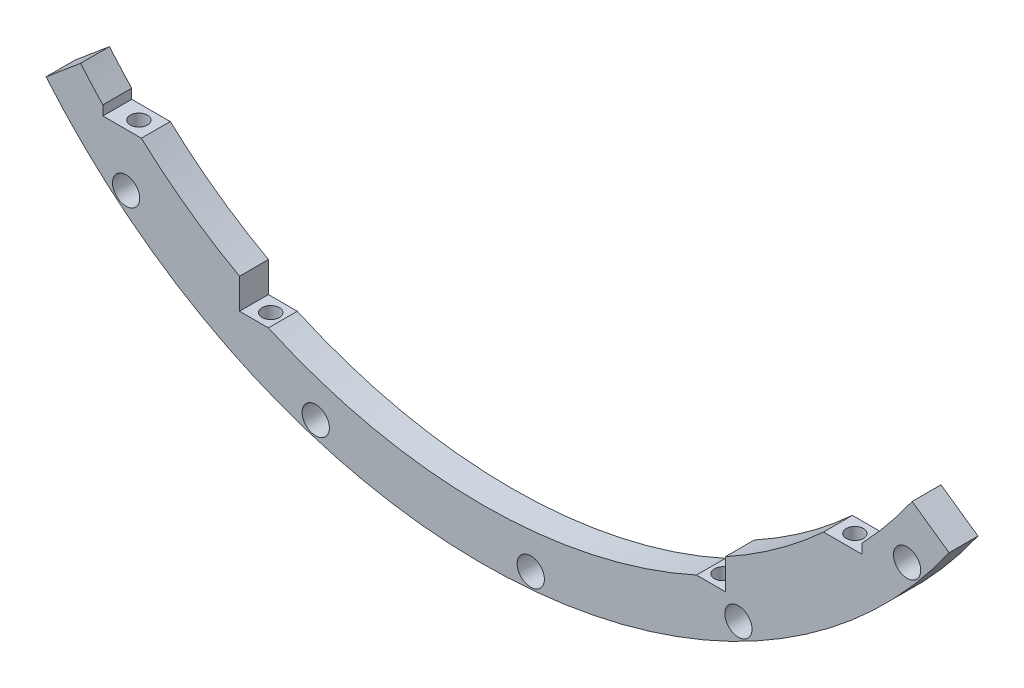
ISO-10303-21;
HEADER;
FILE_DESCRIPTION(('STEP AP214'),'2;1');
FILE_NAME('part.step','',(''),(''),'','','');
FILE_SCHEMA(('AUTOMOTIVE_DESIGN { 1 0 10303 214 1 1 1 1 }'));
ENDSEC;
DATA;
#1=APPLICATION_CONTEXT('core data for automotive mechanical design processes');
#2=APPLICATION_PROTOCOL_DEFINITION('international standard','automotive_design',2000,#1);
#3=PRODUCT_CONTEXT('',#1,'mechanical');
#4=PRODUCT('Part','Part','',(#3));
#5=PRODUCT_RELATED_PRODUCT_CATEGORY('part','',(#4));
#6=PRODUCT_DEFINITION_FORMATION('','',#4);
#7=PRODUCT_DEFINITION_CONTEXT('part definition',#1,'design');
#8=PRODUCT_DEFINITION('design','',#6,#7);
#9=PRODUCT_DEFINITION_SHAPE('','',#8);
#10=(LENGTH_UNIT() NAMED_UNIT(*) SI_UNIT(.MILLI.,.METRE.));
#11=(NAMED_UNIT(*) PLANE_ANGLE_UNIT() SI_UNIT($,.RADIAN.));
#12=(NAMED_UNIT(*) SI_UNIT($,.STERADIAN.) SOLID_ANGLE_UNIT());
#13=UNCERTAINTY_MEASURE_WITH_UNIT(LENGTH_MEASURE(1.E-05),#10,'distance_accuracy_value','');
#14=(GEOMETRIC_REPRESENTATION_CONTEXT(3) GLOBAL_UNCERTAINTY_ASSIGNED_CONTEXT((#13)) GLOBAL_UNIT_ASSIGNED_CONTEXT((#10,
#11,#12)) REPRESENTATION_CONTEXT('',''));
#15=CARTESIAN_POINT('',(0.,0.,0.));
#16=DIRECTION('',(0.,0.,1.));
#17=DIRECTION('',(1.,0.,0.));
#18=AXIS2_PLACEMENT_3D('',#15,#16,#17);
#19=CARTESIAN_POINT('',(35.306,-77.932869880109,4.7625));
#20=DIRECTION('',(0.,-1.,0.));
#21=DIRECTION('',(1.,0.,0.));
#22=AXIS2_PLACEMENT_3D('',#19,#20,#21);
#23=PLANE('',#22);
#24=DIRECTION('',(-1.,0.,0.));
#25=VECTOR('',#24,1.);
#26=CARTESIAN_POINT('',(35.306,-77.932869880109,0.));
#27=LINE('',#26,#25);
#28=CARTESIAN_POINT('',(40.0685,-77.932869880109,0.));
#29=VERTEX_POINT('',#28);
#30=CARTESIAN_POINT('',(35.306,-77.932869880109,0.));
#31=VERTEX_POINT('',#30);
#32=EDGE_CURVE('E209',#29,#31,#27,.T.);
#33=ORIENTED_EDGE('',*,*,#32,.T.);
#34=DIRECTION('',(0.,0.,-1.));
#35=VECTOR('',#34,1.);
#36=CARTESIAN_POINT('',(35.306,-77.932869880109,4.7625));
#37=LINE('',#36,#35);
#38=CARTESIAN_POINT('',(35.306,-77.932869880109,4.7625));
#39=VERTEX_POINT('',#38);
#40=EDGE_CURVE('E173',#39,#31,#37,.T.);
#41=ORIENTED_EDGE('',*,*,#40,.F.);
#42=DIRECTION('',(-1.,0.,0.));
#43=VECTOR('',#42,1.);
#44=CARTESIAN_POINT('',(35.306,-77.932869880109,4.7625));
#45=LINE('',#44,#43);
#46=CARTESIAN_POINT('',(40.0685,-77.932869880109,4.7625));
#47=VERTEX_POINT('',#46);
#48=EDGE_CURVE('E164',#47,#39,#45,.T.);
#49=ORIENTED_EDGE('',*,*,#48,.F.);
#50=DIRECTION('',(0.,0.,-1.));
#51=VECTOR('',#50,1.);
#52=CARTESIAN_POINT('',(40.0685,-77.932869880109,4.7625));
#53=LINE('',#52,#51);
#54=EDGE_CURVE('E218',#47,#29,#53,.T.);
#55=ORIENTED_EDGE('',*,*,#54,.T.);
#56=EDGE_LOOP('',(#33,#41,#49,#55));
#57=FACE_BOUND('',#56,.T.);
#58=CARTESIAN_POINT('',(37.30625,-77.9328698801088,2.38125));
#59=DIRECTION('',(0.,1.,0.));
#60=DIRECTION('',(0.,0.,1.));
#61=AXIS2_PLACEMENT_3D('',#58,#59,#60);
#62=CIRCLE('',#61,1.42239999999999);
#63=CARTESIAN_POINT('',(37.30625,-77.9328698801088,3.80364999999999));
#64=VERTEX_POINT('',#63);
#65=EDGE_CURVE('E381',#64,#64,#62,.T.);
#66=ORIENTED_EDGE('',*,*,#65,.F.);
#67=EDGE_LOOP('',(#66));
#68=FACE_BOUND('',#67,.T.);
#69=ADVANCED_FACE('F30',(#57,#68),#23,.F.);
#70=CARTESIAN_POINT('',(-40.0685,-77.932869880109,4.7625));
#71=DIRECTION('',(0.,-1.,0.));
#72=DIRECTION('',(1.,0.,0.));
#73=AXIS2_PLACEMENT_3D('',#70,#71,#72);
#74=PLANE('',#73);
#75=DIRECTION('',(-1.,0.,0.));
#76=VECTOR('',#75,1.);
#77=CARTESIAN_POINT('',(-40.0685,-77.932869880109,0.));
#78=LINE('',#77,#76);
#79=CARTESIAN_POINT('',(-35.306,-77.932869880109,0.));
#80=VERTEX_POINT('',#79);
#81=CARTESIAN_POINT('',(-40.0685,-77.932869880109,0.));
#82=VERTEX_POINT('',#81);
#83=EDGE_CURVE('E106',#80,#82,#78,.T.);
#84=ORIENTED_EDGE('',*,*,#83,.T.);
#85=DIRECTION('',(0.,0.,-1.));
#86=VECTOR('',#85,1.);
#87=CARTESIAN_POINT('',(-40.0685,-77.932869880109,4.7625));
#88=LINE('',#87,#86);
#89=CARTESIAN_POINT('',(-40.0685,-77.932869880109,4.7625));
#90=VERTEX_POINT('',#89);
#91=EDGE_CURVE('E174',#90,#82,#88,.T.);
#92=ORIENTED_EDGE('',*,*,#91,.F.);
#93=DIRECTION('',(-1.,0.,0.));
#94=VECTOR('',#93,1.);
#95=CARTESIAN_POINT('',(-40.0685,-77.932869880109,4.7625));
#96=LINE('',#95,#94);
#97=CARTESIAN_POINT('',(-35.306,-77.932869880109,4.7625));
#98=VERTEX_POINT('',#97);
#99=EDGE_CURVE('E162',#98,#90,#96,.T.);
#100=ORIENTED_EDGE('',*,*,#99,.F.);
#101=DIRECTION('',(0.,0.,-1.));
#102=VECTOR('',#101,1.);
#103=CARTESIAN_POINT('',(-35.306,-77.932869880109,4.7625));
#104=LINE('',#103,#102);
#105=EDGE_CURVE('E169',#98,#80,#104,.T.);
#106=ORIENTED_EDGE('',*,*,#105,.T.);
#107=EDGE_LOOP('',(#84,#92,#100,#106));
#108=FACE_BOUND('',#107,.T.);
#109=CARTESIAN_POINT('',(-37.30625,-77.932869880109,2.38125));
#110=DIRECTION('',(0.,1.,0.));
#111=DIRECTION('',(0.,0.,1.));
#112=AXIS2_PLACEMENT_3D('',#109,#110,#111);
#113=CIRCLE('',#112,1.42239999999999);
#114=CARTESIAN_POINT('',(-37.30625,-77.932869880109,3.80364999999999));
#115=VERTEX_POINT('',#114);
#116=EDGE_CURVE('E391',#115,#115,#113,.T.);
#117=ORIENTED_EDGE('',*,*,#116,.F.);
#118=EDGE_LOOP('',(#117));
#119=FACE_BOUND('',#118,.T.);
#120=ADVANCED_FACE('F176',(#108,#119),#74,.F.);
#121=CARTESIAN_POINT('',(0.,0.,4.7625));
#122=DIRECTION('',(0.,0.,-1.));
#123=DIRECTION('',(-1.,0.,0.));
#124=AXIS2_PLACEMENT_3D('',#121,#122,#123);
#125=CYLINDRICAL_SURFACE('',#124,83.2116560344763);
#126=CARTESIAN_POINT('',(0.,0.,0.));
#127=DIRECTION('',(0.,0.,-1.));
#128=DIRECTION('',(-1.,0.,0.));
#129=AXIS2_PLACEMENT_3D('',#126,#127,#128);
#130=CIRCLE('',#129,83.2116560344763);
#131=CARTESIAN_POINT('',(-40.0685,-72.9293837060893,0.));
#132=VERTEX_POINT('',#131);
#133=CARTESIAN_POINT('',(-56.261,-61.3097021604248,0.));
#134=VERTEX_POINT('',#133);
#135=EDGE_CURVE('E183',#132,#134,#130,.T.);
#136=ORIENTED_EDGE('',*,*,#135,.T.);
#137=DIRECTION('',(0.,0.,-1.));
#138=VECTOR('',#137,1.);
#139=CARTESIAN_POINT('',(-56.261,-61.3097021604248,4.7625));
#140=LINE('',#139,#138);
#141=CARTESIAN_POINT('',(-56.261,-61.3097021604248,4.7625));
#142=VERTEX_POINT('',#141);
#143=EDGE_CURVE('E11',#142,#134,#140,.T.);
#144=ORIENTED_EDGE('',*,*,#143,.F.);
#145=CARTESIAN_POINT('',(0.,0.,4.7625));
#146=DIRECTION('',(0.,0.,-1.));
#147=DIRECTION('',(-1.,0.,0.));
#148=AXIS2_PLACEMENT_3D('',#145,#146,#147);
#149=CIRCLE('',#148,83.2116560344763);
#150=CARTESIAN_POINT('',(-40.0685,-72.9293837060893,4.7625));
#151=VERTEX_POINT('',#150);
#152=EDGE_CURVE('E214',#151,#142,#149,.T.);
#153=ORIENTED_EDGE('',*,*,#152,.F.);
#154=DIRECTION('',(0.,0.,-1.));
#155=VECTOR('',#154,1.);
#156=CARTESIAN_POINT('',(-40.0685,-72.9293837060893,4.7625));
#157=LINE('',#156,#155);
#158=EDGE_CURVE('E179',#151,#132,#157,.T.);
#159=ORIENTED_EDGE('',*,*,#158,.T.);
#160=EDGE_LOOP('',(#136,#144,#153,#159));
#161=FACE_BOUND('',#160,.T.);
#162=ADVANCED_FACE('F32',(#161),#125,.F.);
#163=CARTESIAN_POINT('',(-62.611,-61.3097021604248,4.7625));
#164=DIRECTION('',(0.,-1.,0.));
#165=DIRECTION('',(0.,0.,-1.));
#166=AXIS2_PLACEMENT_3D('',#163,#164,#165);
#167=PLANE('',#166);
#168=CARTESIAN_POINT('',(-59.055,-61.3097021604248,2.38125));
#169=DIRECTION('',(0.,1.,0.));
#170=DIRECTION('',(0.,0.,1.));
#171=AXIS2_PLACEMENT_3D('',#168,#169,#170);
#172=CIRCLE('',#171,1.4224);
#173=CARTESIAN_POINT('',(-59.055,-61.3097021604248,3.80365));
#174=VERTEX_POINT('',#173);
#175=EDGE_CURVE('E359',#174,#174,#172,.T.);
#176=ORIENTED_EDGE('',*,*,#175,.F.);
#177=EDGE_LOOP('',(#176));
#178=FACE_BOUND('',#177,.T.);
#179=DIRECTION('',(-1.,0.,0.));
#180=VECTOR('',#179,1.);
#181=CARTESIAN_POINT('',(-62.611,-61.3097021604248,0.));
#182=LINE('',#181,#180);
#183=CARTESIAN_POINT('',(-62.611,-61.3097021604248,0.));
#184=VERTEX_POINT('',#183);
#185=EDGE_CURVE('E186',#134,#184,#182,.T.);
#186=ORIENTED_EDGE('',*,*,#185,.T.);
#187=DIRECTION('',(0.,0.,-1.));
#188=VECTOR('',#187,1.);
#189=CARTESIAN_POINT('',(-62.611,-61.3097021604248,4.7625));
#190=LINE('',#189,#188);
#191=CARTESIAN_POINT('',(-62.611,-61.3097021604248,4.7625));
#192=VERTEX_POINT('',#191);
#193=EDGE_CURVE('E44',#192,#184,#190,.T.);
#194=ORIENTED_EDGE('',*,*,#193,.F.);
#195=DIRECTION('',(-1.,0.,0.));
#196=VECTOR('',#195,1.);
#197=CARTESIAN_POINT('',(-62.611,-61.3097021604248,4.7625));
#198=LINE('',#197,#196);
#199=EDGE_CURVE('E120',#142,#192,#198,.T.);
#200=ORIENTED_EDGE('',*,*,#199,.F.);
#201=ORIENTED_EDGE('',*,*,#143,.T.);
#202=EDGE_LOOP('',(#186,#194,#200,#201));
#203=FACE_BOUND('',#202,.T.);
#204=ADVANCED_FACE('F351',(#178,#203),#167,.F.);
#205=CARTESIAN_POINT('',(-62.611,-61.3097021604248,4.7625));
#206=DIRECTION('',(-1.,0.,0.));
#207=DIRECTION('',(0.,0.,1.));
#208=AXIS2_PLACEMENT_3D('',#205,#206,#207);
#209=PLANE('',#208);
#210=DIRECTION('',(0.,1.,0.));
#211=VECTOR('',#210,1.);
#212=CARTESIAN_POINT('',(-62.611,-61.3097021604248,0.));
#213=LINE('',#212,#211);
#214=CARTESIAN_POINT('',(-62.611,-59.7222021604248,0.));
#215=VERTEX_POINT('',#214);
#216=EDGE_CURVE('E189',#184,#215,#213,.T.);
#217=ORIENTED_EDGE('',*,*,#216,.T.);
#218=DIRECTION('',(0.,0.,-1.));
#219=VECTOR('',#218,1.);
#220=CARTESIAN_POINT('',(-62.611,-59.7222021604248,4.7625));
#221=LINE('',#220,#219);
#222=CARTESIAN_POINT('',(-62.611,-59.7222021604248,4.7625));
#223=VERTEX_POINT('',#222);
#224=EDGE_CURVE('E245',#223,#215,#221,.T.);
#225=ORIENTED_EDGE('',*,*,#224,.F.);
#226=DIRECTION('',(0.,1.,0.));
#227=VECTOR('',#226,1.);
#228=CARTESIAN_POINT('',(-62.611,-61.3097021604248,4.7625));
#229=LINE('',#228,#227);
#230=EDGE_CURVE('E254',#192,#223,#229,.T.);
#231=ORIENTED_EDGE('',*,*,#230,.F.);
#232=ORIENTED_EDGE('',*,*,#193,.T.);
#233=EDGE_LOOP('',(#217,#225,#231,#232));
#234=FACE_BOUND('',#233,.T.);
#235=ADVANCED_FACE('F252',(#234),#209,.F.);
#236=CARTESIAN_POINT('',(0.,0.,4.7625));
#237=DIRECTION('',(0.,0.,-1.));
#238=DIRECTION('',(-1.,0.,0.));
#239=AXIS2_PLACEMENT_3D('',#236,#237,#238);
#240=CYLINDRICAL_SURFACE('',#239,86.5267516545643);
#241=CARTESIAN_POINT('',(0.,0.,0.));
#242=DIRECTION('',(0.,0.,-1.));
#243=DIRECTION('',(-1.,0.,0.));
#244=AXIS2_PLACEMENT_3D('',#241,#242,#243);
#245=CIRCLE('',#244,86.5267516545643);
#246=CARTESIAN_POINT('',(-66.2833372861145,-55.6183238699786,0.));
#247=VERTEX_POINT('',#246);
#248=EDGE_CURVE('E191',#215,#247,#245,.T.);
#249=ORIENTED_EDGE('',*,*,#248,.T.);
#250=DIRECTION('',(0.,0.,-1.));
#251=VECTOR('',#250,1.);
#252=CARTESIAN_POINT('',(-66.2833372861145,-55.6183238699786,4.7625));
#253=LINE('',#252,#251);
#254=CARTESIAN_POINT('',(-66.2833372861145,-55.6183238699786,4.7625));
#255=VERTEX_POINT('',#254);
#256=EDGE_CURVE('E242',#255,#247,#253,.T.);
#257=ORIENTED_EDGE('',*,*,#256,.F.);
#258=CARTESIAN_POINT('',(0.,0.,4.7625));
#259=DIRECTION('',(0.,0.,-1.));
#260=DIRECTION('',(-1.,0.,0.));
#261=AXIS2_PLACEMENT_3D('',#258,#259,#260);
#262=CIRCLE('',#261,86.5267516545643);
#263=EDGE_CURVE('E272',#223,#255,#262,.T.);
#264=ORIENTED_EDGE('',*,*,#263,.F.);
#265=ORIENTED_EDGE('',*,*,#224,.T.);
#266=EDGE_LOOP('',(#249,#257,#264,#265));
#267=FACE_BOUND('',#266,.T.);
#268=ADVANCED_FACE('F263',(#267),#240,.F.);
#269=CARTESIAN_POINT('',(-71.9928567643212,-60.4091795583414,4.7625));
#270=DIRECTION('',(0.642787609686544,-0.766044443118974,0.));
#271=DIRECTION('',(0.766044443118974,0.642787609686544,0.));
#272=AXIS2_PLACEMENT_3D('',#269,#270,#271);
#273=PLANE('',#272);
#274=DIRECTION('',(-0.766044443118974,-0.642787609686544,0.));
#275=VECTOR('',#274,1.);
#276=CARTESIAN_POINT('',(-71.9928567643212,-60.4091795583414,0.));
#277=LINE('',#276,#275);
#278=CARTESIAN_POINT('',(-71.9928567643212,-60.4091795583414,0.));
#279=VERTEX_POINT('',#278);
#280=EDGE_CURVE('E193',#247,#279,#277,.T.);
#281=ORIENTED_EDGE('',*,*,#280,.T.);
#282=DIRECTION('',(0.,0.,-1.));
#283=VECTOR('',#282,1.);
#284=CARTESIAN_POINT('',(-71.9928567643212,-60.4091795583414,4.7625));
#285=LINE('',#284,#283);
#286=CARTESIAN_POINT('',(-71.9928567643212,-60.4091795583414,4.7625));
#287=VERTEX_POINT('',#286);
#288=EDGE_CURVE('E239',#287,#279,#285,.T.);
#289=ORIENTED_EDGE('',*,*,#288,.F.);
#290=DIRECTION('',(-0.766044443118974,-0.642787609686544,0.));
#291=VECTOR('',#290,1.);
#292=CARTESIAN_POINT('',(-71.9928567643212,-60.4091795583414,4.7625));
#293=LINE('',#292,#291);
#294=EDGE_CURVE('E269',#255,#287,#293,.T.);
#295=ORIENTED_EDGE('',*,*,#294,.F.);
#296=ORIENTED_EDGE('',*,*,#256,.T.);
#297=EDGE_LOOP('',(#281,#289,#295,#296));
#298=FACE_BOUND('',#297,.T.);
#299=ADVANCED_FACE('F267',(#298),#273,.F.);
#300=CARTESIAN_POINT('',(0.,0.,4.7625));
#301=DIRECTION('',(0.,0.,-1.));
#302=DIRECTION('',(-1.,0.,0.));
#303=AXIS2_PLACEMENT_3D('',#300,#301,#302);
#304=CYLINDRICAL_SURFACE('',#303,93.98);
#305=CARTESIAN_POINT('',(37.30625,-86.2582408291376,3.80364999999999));
#306=CARTESIAN_POINT('',(37.3921606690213,-86.2210846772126,3.8036470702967));
#307=CARTESIAN_POINT('',(37.4780852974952,-86.1837689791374,3.79585111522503));
#308=CARTESIAN_POINT('',(37.6475419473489,-86.1098807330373,3.76478889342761));
#309=CARTESIAN_POINT('',(37.73107026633,-86.0733093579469,3.74149990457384));
#310=CARTESIAN_POINT('',(37.8933334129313,-86.0019973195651,3.67974754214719));
#311=CARTESIAN_POINT('',(37.972062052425,-85.9672590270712,3.64126503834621));
#312=CARTESIAN_POINT('',(38.1220209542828,-85.9008652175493,3.54977337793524));
#313=CARTESIAN_POINT('',(38.1932547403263,-85.8692082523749,3.49677109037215));
#314=CARTESIAN_POINT('',(38.322669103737,-85.811527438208,3.37993795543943));
#315=CARTESIAN_POINT('',(38.3812844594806,-85.7853177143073,3.31668241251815));
#316=CARTESIAN_POINT('',(38.4867989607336,-85.7380315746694,3.1793776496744));
#317=CARTESIAN_POINT('',(38.5337049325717,-85.7169521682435,3.10533475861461));
#318=CARTESIAN_POINT('',(38.6099997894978,-85.6826115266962,2.95560628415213));
#319=CARTESIAN_POINT('',(38.640569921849,-85.6688242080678,2.88064338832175));
#320=CARTESIAN_POINT('',(38.6886514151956,-85.647121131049,2.7258425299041));
#321=CARTESIAN_POINT('',(38.7061706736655,-85.639201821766,2.64600754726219));
#322=CARTESIAN_POINT('',(38.7264243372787,-85.6300447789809,2.49064860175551));
#323=CARTESIAN_POINT('',(38.7302298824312,-85.6283229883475,2.41529103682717));
#324=CARTESIAN_POINT('',(38.725882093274,-85.6302894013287,2.26500207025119));
#325=CARTESIAN_POINT('',(38.7177313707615,-85.6339764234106,2.19007057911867));
#326=CARTESIAN_POINT('',(38.6902470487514,-85.6463974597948,2.04499044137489));
#327=CARTESIAN_POINT('',(38.6712417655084,-85.6549832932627,1.9747662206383));
#328=CARTESIAN_POINT('',(38.623073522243,-85.6767137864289,1.83865327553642));
#329=CARTESIAN_POINT('',(38.5939095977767,-85.6898588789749,1.77276496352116));
#330=CARTESIAN_POINT('',(38.5253988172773,-85.7206830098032,1.64481720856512));
#331=CARTESIAN_POINT('',(38.4857536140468,-85.7384947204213,1.58295004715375));
#332=CARTESIAN_POINT('',(38.3981323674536,-85.7777717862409,1.46674734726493));
#333=CARTESIAN_POINT('',(38.3501539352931,-85.7992381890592,1.41241397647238));
#334=CARTESIAN_POINT('',(38.2434455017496,-85.8468574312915,1.30847867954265));
#335=CARTESIAN_POINT('',(38.1841804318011,-85.8732404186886,1.25953212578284));
#336=CARTESIAN_POINT('',(38.0594142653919,-85.9286101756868,1.17221324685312));
#337=CARTESIAN_POINT('',(37.9939108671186,-85.9575979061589,1.13384484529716));
#338=CARTESIAN_POINT('',(37.8525406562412,-86.019951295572,1.06539714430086));
#339=CARTESIAN_POINT('',(37.7762665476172,-86.0534794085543,1.0363057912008));
#340=CARTESIAN_POINT('',(37.6203784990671,-86.1217438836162,0.991600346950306));
#341=CARTESIAN_POINT('',(37.5407634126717,-86.1564806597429,0.975990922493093));
#342=CARTESIAN_POINT('',(37.3751907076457,-86.2284416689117,0.957935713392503));
#343=CARTESIAN_POINT('',(37.2891455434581,-86.2656867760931,0.956364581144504));
#344=CARTESIAN_POINT('',(37.1178766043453,-86.3395178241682,0.968765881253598));
#345=CARTESIAN_POINT('',(37.032652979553,-86.3761036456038,0.982741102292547));
#346=CARTESIAN_POINT('',(36.8644642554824,-86.4480198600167,1.02637633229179));
#347=CARTESIAN_POINT('',(36.7815381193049,-86.4833301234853,1.05622107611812));
#348=CARTESIAN_POINT('',(36.6216894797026,-86.5511397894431,1.13129401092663));
#349=CARTESIAN_POINT('',(36.544765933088,-86.5836396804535,1.17651952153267));
#350=CARTESIAN_POINT('',(36.402920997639,-86.6433691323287,1.27918620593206));
#351=CARTESIAN_POINT('',(36.3376212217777,-86.6707673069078,1.33600475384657));
#352=CARTESIAN_POINT('',(36.217641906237,-86.7209723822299,1.4616381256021));
#353=CARTESIAN_POINT('',(36.1629567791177,-86.7437816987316,1.53044660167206));
#354=CARTESIAN_POINT('',(36.0704382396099,-86.7822920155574,1.67231188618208));
#355=CARTESIAN_POINT('',(36.0316199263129,-86.7984100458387,1.74461295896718));
#356=CARTESIAN_POINT('',(35.9667839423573,-86.8252964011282,1.89566225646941));
#357=CARTESIAN_POINT('',(35.9407594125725,-86.8360675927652,1.97440700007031));
#358=CARTESIAN_POINT('',(35.9041600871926,-86.8512063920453,2.12974467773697));
#359=CARTESIAN_POINT('',(35.8925789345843,-86.8559911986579,2.20606103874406));
#360=CARTESIAN_POINT('',(35.8819320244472,-86.8603902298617,2.35970247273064));
#361=CARTESIAN_POINT('',(35.8828628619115,-86.8600058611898,2.43702726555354));
#362=CARTESIAN_POINT('',(35.8969223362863,-86.8541963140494,2.58743052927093));
#363=CARTESIAN_POINT('',(35.9095941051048,-86.8489599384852,2.66055973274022));
#364=CARTESIAN_POINT('',(35.9459734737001,-86.8339091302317,2.8035175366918));
#365=CARTESIAN_POINT('',(35.9696811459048,-86.8240946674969,2.87334611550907));
#366=CARTESIAN_POINT('',(36.0275711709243,-86.8000893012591,3.00869279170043));
#367=CARTESIAN_POINT('',(36.0618736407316,-86.7858481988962,3.07415041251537));
#368=CARTESIAN_POINT('',(36.1396290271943,-86.7534978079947,3.19830948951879));
#369=CARTESIAN_POINT('',(36.1830833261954,-86.7353879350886,3.25700992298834));
#370=CARTESIAN_POINT('',(36.2802692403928,-86.694782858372,3.36937499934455));
#371=CARTESIAN_POINT('',(36.3344235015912,-86.6721060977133,3.42260783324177));
#372=CARTESIAN_POINT('',(36.4496691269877,-86.6237030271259,3.51929885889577));
#373=CARTESIAN_POINT('',(36.510764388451,-86.5979750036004,3.56275151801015));
#374=CARTESIAN_POINT('',(36.6430271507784,-86.5420966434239,3.64210151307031));
#375=CARTESIAN_POINT('',(36.71460698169,-86.511758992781,3.6771784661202));
#376=CARTESIAN_POINT('',(36.8617878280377,-86.449149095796,3.73473148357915));
#377=CARTESIAN_POINT('',(36.9373854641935,-86.4168784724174,3.75721795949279));
#378=CARTESIAN_POINT('',(37.0621821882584,-86.3634055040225,3.78341881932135));
#379=CARTESIAN_POINT('',(37.1107518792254,-86.3425463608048,3.79100383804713));
#380=CARTESIAN_POINT('',(37.2082961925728,-86.3005557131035,3.80112034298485));
#381=CARTESIAN_POINT('',(37.2572708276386,-86.2794242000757,3.80365167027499));
#382=CARTESIAN_POINT('',(37.30625,-86.2582408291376,3.80364999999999));
#383=B_SPLINE_CURVE_WITH_KNOTS('',3,(#305,#306,#307,#308,#309,#310,#311,#312,#313,#314,#315,
#316,#317,#318,#319,#320,#321,#322,#323,#324,#325,#326,#327,#328,#329,#330,#331,#332,#333,#334,
#335,#336,#337,#338,#339,#340,#341,#342,#343,#344,#345,#346,#347,#348,#349,#350,#351,#352,#353,
#354,#355,#356,#357,#358,#359,#360,#361,#362,#363,#364,#365,#366,#367,#368,#369,#370,#371,#372,
#373,#374,#375,#376,#377,#378,#379,#380,#381,#382),.UNSPECIFIED.,.T.,.F.,(4,2,2,2,2,2,2,2,2,2,2,
2,2,2,2,2,2,2,2,2,2,2,2,2,2,2,2,2,2,2,2,2,2,2,2,2,2,2,4),(0.,0.280613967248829,
0.561640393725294,0.843021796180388,1.1242703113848,1.39321228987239,1.66199711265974,
1.90704214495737,2.15193877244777,2.37723396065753,2.60247994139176,2.82124871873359,
3.04003827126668,3.26589116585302,3.49180891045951,3.73458069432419,3.9774424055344,
4.24104827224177,4.50474534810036,4.78476551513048,5.06483591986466,5.34824034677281,
5.63159541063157,5.90252520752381,6.17331200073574,6.42287395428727,6.67230196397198,
6.90315201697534,7.13393924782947,7.35610691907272,7.57827604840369,7.8030626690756,
8.02788326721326,8.26461980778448,8.50148993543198,8.7562817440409,9.01086254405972,
9.17084043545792,9.3308233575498),.UNSPECIFIED.);
#384=CARTESIAN_POINT('',(37.30625,-86.2582408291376,3.80364999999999));
#385=VERTEX_POINT('',#384);
#386=EDGE_CURVE('E384',#385,#385,#383,.T.);
#387=ORIENTED_EDGE('',*,*,#386,.T.);
#388=EDGE_LOOP('',(#387));
#389=FACE_BOUND('',#388,.T.);
#390=CARTESIAN_POINT('',(-37.30625,-86.2582408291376,3.80364999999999));
#391=CARTESIAN_POINT('',(-37.2210873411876,-86.2950730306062,3.80364712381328));
#392=CARTESIAN_POINT('',(-37.1358043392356,-86.3318064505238,3.79598679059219));
#393=CARTESIAN_POINT('',(-36.9673897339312,-86.4040561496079,3.76535127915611));
#394=CARTESIAN_POINT('',(-36.8842611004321,-86.4395707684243,3.74235601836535));
#395=CARTESIAN_POINT('',(-36.7225543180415,-86.5083934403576,3.68125006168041));
#396=CARTESIAN_POINT('',(-36.6439840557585,-86.5416976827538,3.64311401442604));
#397=CARTESIAN_POINT('',(-36.4942137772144,-86.604961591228,3.55235128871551));
#398=CARTESIAN_POINT('',(-36.4230101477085,-86.6349228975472,3.49973176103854));
#399=CARTESIAN_POINT('',(-36.2939290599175,-86.689075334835,3.38403085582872));
#400=CARTESIAN_POINT('',(-36.2355703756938,-86.7134769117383,3.32158649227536));
#401=CARTESIAN_POINT('',(-36.1303649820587,-86.757365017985,3.18614540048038));
#402=CARTESIAN_POINT('',(-36.0835123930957,-86.7768540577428,3.11315409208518));
#403=CARTESIAN_POINT('',(-36.0067395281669,-86.808736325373,2.96509685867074));
#404=CARTESIAN_POINT('',(-35.9757542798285,-86.8215768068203,2.89067914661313));
#405=CARTESIAN_POINT('',(-35.9267031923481,-86.8418856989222,2.73701247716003));
#406=CARTESIAN_POINT('',(-35.9086311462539,-86.8493566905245,2.65776586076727));
#407=CARTESIAN_POINT('',(-35.8869953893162,-86.8582989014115,2.50240167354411));
#408=CARTESIAN_POINT('',(-35.8825452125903,-86.8601367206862,2.42642743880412));
#409=CARTESIAN_POINT('',(-35.8858148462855,-86.8587859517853,2.27479420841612));
#410=CARTESIAN_POINT('',(-35.8935323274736,-86.8555983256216,2.19913515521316));
#411=CARTESIAN_POINT('',(-35.9204778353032,-86.8444579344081,2.05214594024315));
#412=CARTESIAN_POINT('',(-35.9394277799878,-86.8366202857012,1.98075562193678));
#413=CARTESIAN_POINT('',(-35.9878633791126,-86.8165581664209,1.84230809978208));
#414=CARTESIAN_POINT('',(-36.0173497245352,-86.8043334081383,1.77525118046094));
#415=CARTESIAN_POINT('',(-36.086641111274,-86.7755505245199,1.64550664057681));
#416=CARTESIAN_POINT('',(-36.1266836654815,-86.7588925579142,1.58296839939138));
#417=CARTESIAN_POINT('',(-36.2153384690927,-86.7219231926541,1.46552538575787));
#418=CARTESIAN_POINT('',(-36.2639527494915,-86.7016109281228,1.41062242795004));
#419=CARTESIAN_POINT('',(-36.3714877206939,-86.6565570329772,1.30635990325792));
#420=CARTESIAN_POINT('',(-36.4308587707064,-86.6316196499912,1.25755001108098));
#421=CARTESIAN_POINT('',(-36.555801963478,-86.5789716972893,1.17052635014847));
#422=CARTESIAN_POINT('',(-36.6213761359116,-86.55126021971,1.13231606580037));
#423=CARTESIAN_POINT('',(-36.7622125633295,-86.4915395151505,1.06450717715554));
#424=CARTESIAN_POINT('',(-36.8378320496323,-86.4593636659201,1.03579685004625));
#425=CARTESIAN_POINT('',(-36.9921895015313,-86.3934335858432,0.991631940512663));
#426=CARTESIAN_POINT('',(-37.0709285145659,-86.3596788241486,0.976181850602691));
#427=CARTESIAN_POINT('',(-37.2347319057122,-86.2891858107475,0.958109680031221));
#428=CARTESIAN_POINT('',(-37.3198745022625,-86.2523963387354,0.956387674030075));
#429=CARTESIAN_POINT('',(-37.4891809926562,-86.1789430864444,0.968110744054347));
#430=CARTESIAN_POINT('',(-37.5733446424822,-86.1422793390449,0.981559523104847));
#431=CARTESIAN_POINT('',(-37.7404923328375,-86.0691824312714,1.02394609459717));
#432=CARTESIAN_POINT('',(-37.8233927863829,-86.0327785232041,1.05326679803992));
#433=CARTESIAN_POINT('',(-37.9832099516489,-85.9623393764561,1.12717865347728));
#434=CARTESIAN_POINT('',(-38.0601269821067,-85.9283040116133,1.1717689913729));
#435=CARTESIAN_POINT('',(-38.2029527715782,-85.864898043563,1.27373256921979));
#436=CARTESIAN_POINT('',(-38.2691363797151,-85.8354124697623,1.33064762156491));
#437=CARTESIAN_POINT('',(-38.3908164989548,-85.7810588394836,1.45680205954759));
#438=CARTESIAN_POINT('',(-38.4463187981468,-85.7561882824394,1.52603473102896));
#439=CARTESIAN_POINT('',(-38.5401454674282,-85.7140596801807,1.66890925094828));
#440=CARTESIAN_POINT('',(-38.5794952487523,-85.6963490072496,1.74174324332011));
#441=CARTESIAN_POINT('',(-38.6452103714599,-85.6667346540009,1.89413842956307));
#442=CARTESIAN_POINT('',(-38.6715844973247,-85.6548270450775,1.97369502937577));
#443=CARTESIAN_POINT('',(-38.7083080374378,-85.6382371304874,2.12965465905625));
#444=CARTESIAN_POINT('',(-38.7198658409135,-85.6330101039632,2.20571677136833));
#445=CARTESIAN_POINT('',(-38.7305419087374,-85.6281820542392,2.35887757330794));
#446=CARTESIAN_POINT('',(-38.7296643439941,-85.6285791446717,2.43597590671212));
#447=CARTESIAN_POINT('',(-38.7158566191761,-85.6348229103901,2.58515886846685));
#448=CARTESIAN_POINT('',(-38.7034975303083,-85.6404113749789,2.65730833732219));
#449=CARTESIAN_POINT('',(-38.668062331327,-85.6564167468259,2.79835522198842));
#450=CARTESIAN_POINT('',(-38.6449860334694,-85.6668337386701,2.86725258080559));
#451=CARTESIAN_POINT('',(-38.5886081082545,-85.6922440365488,3.0010293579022));
#452=CARTESIAN_POINT('',(-38.5551616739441,-85.7073021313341,3.06583515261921));
#453=CARTESIAN_POINT('',(-38.4793722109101,-85.7413554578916,3.18885749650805));
#454=CARTESIAN_POINT('',(-38.437027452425,-85.76035145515,3.24707276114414));
#455=CARTESIAN_POINT('',(-38.3417922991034,-85.8029734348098,3.35932714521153));
#456=CARTESIAN_POINT('',(-38.2883977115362,-85.8268190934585,3.41285433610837));
#457=CARTESIAN_POINT('',(-38.1746586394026,-85.8774691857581,3.51027710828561));
#458=CARTESIAN_POINT('',(-38.1143099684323,-85.9042754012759,3.55416684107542));
#459=CARTESIAN_POINT('',(-37.9828331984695,-85.962494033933,3.63501040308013));
#460=CARTESIAN_POINT('',(-37.9112242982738,-85.9941043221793,3.67103899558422));
#461=CARTESIAN_POINT('',(-37.763714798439,-86.058983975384,3.73042106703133));
#462=CARTESIAN_POINT('',(-37.6878176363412,-86.0922520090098,3.75378454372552));
#463=CARTESIAN_POINT('',(-37.5606785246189,-86.1477731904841,3.78164867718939));
#464=CARTESIAN_POINT('',(-37.5101242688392,-86.1697977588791,3.78989100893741));
#465=CARTESIAN_POINT('',(-37.4084778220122,-86.2139736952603,3.80089266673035));
#466=CARTESIAN_POINT('',(-37.3573856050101,-86.2361250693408,3.80365172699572));
#467=CARTESIAN_POINT('',(-37.30625,-86.2582408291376,3.80364999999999));
#468=B_SPLINE_CURVE_WITH_KNOTS('',3,(#390,#391,#392,#393,#394,#395,#396,#397,#398,#399,#400,
#401,#402,#403,#404,#405,#406,#407,#408,#409,#410,#411,#412,#413,#414,#415,#416,#417,#418,#419,
#420,#421,#422,#423,#424,#425,#426,#427,#428,#429,#430,#431,#432,#433,#434,#435,#436,#437,#438,
#439,#440,#441,#442,#443,#444,#445,#446,#447,#448,#449,#450,#451,#452,#453,#454,#455,#456,#457,
#458,#459,#460,#461,#462,#463,#464,#465,#466,#467),.UNSPECIFIED.,.T.,.F.,(4,2,2,2,2,2,2,2,2,2,2,
2,2,2,2,2,2,2,2,2,2,2,2,2,2,2,2,2,2,2,2,2,2,2,2,2,2,2,4),(0.,0.278162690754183,
0.556690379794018,0.835686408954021,1.11454493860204,1.37977434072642,1.64486792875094,
1.88846466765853,2.13194423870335,2.35920061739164,2.58641349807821,2.80822331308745,
3.03004767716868,3.25736688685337,3.48474003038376,3.72611694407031,3.96757311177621,
4.22759856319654,4.4877120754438,4.76475010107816,5.04185576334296,5.32596560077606,
5.61006029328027,5.88500087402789,6.15979204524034,6.41238714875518,6.66481100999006,
6.89496708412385,7.1250459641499,7.34426069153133,7.56347925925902,7.78590842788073,
8.00838087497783,8.24520997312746,8.48218239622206,8.73960212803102,8.9968183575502,
9.16383202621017,9.33085378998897),.UNSPECIFIED.);
#469=CARTESIAN_POINT('',(-37.30625,-86.2582408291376,3.80364999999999));
#470=VERTEX_POINT('',#469);
#471=EDGE_CURVE('E495',#470,#470,#468,.T.);
#472=ORIENTED_EDGE('',*,*,#471,.T.);
#473=EDGE_LOOP('',(#472));
#474=FACE_BOUND('',#473,.T.);
#475=CARTESIAN_POINT('',(0.,0.,0.));
#476=DIRECTION('',(0.,0.,1.));
#477=DIRECTION('',(1.,0.,0.));
#478=AXIS2_PLACEMENT_3D('',#475,#476,#477);
#479=CIRCLE('',#478,93.98);
#480=CARTESIAN_POINT('',(76.9839091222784,-53.9047134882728,0.));
#481=VERTEX_POINT('',#480);
#482=EDGE_CURVE('E195',#279,#481,#479,.T.);
#483=ORIENTED_EDGE('',*,*,#482,.T.);
#484=DIRECTION('',(0.,0.,-1.));
#485=VECTOR('',#484,1.);
#486=CARTESIAN_POINT('',(76.9839091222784,-53.9047134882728,4.7625));
#487=LINE('',#486,#485);
#488=CARTESIAN_POINT('',(76.9839091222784,-53.9047134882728,4.7625));
#489=VERTEX_POINT('',#488);
#490=EDGE_CURVE('E236',#489,#481,#487,.T.);
#491=ORIENTED_EDGE('',*,*,#490,.F.);
#492=CARTESIAN_POINT('',(0.,0.,4.7625));
#493=DIRECTION('',(0.,0.,1.));
#494=DIRECTION('',(1.,0.,0.));
#495=AXIS2_PLACEMENT_3D('',#492,#493,#494);
#496=CIRCLE('',#495,93.98);
#497=EDGE_CURVE('E271',#287,#489,#496,.T.);
#498=ORIENTED_EDGE('',*,*,#497,.F.);
#499=ORIENTED_EDGE('',*,*,#288,.T.);
#500=EDGE_LOOP('',(#483,#491,#498,#499));
#501=FACE_BOUND('',#500,.T.);
#502=ADVANCED_FACE('F341',(#389,#474,#501),#304,.T.);
#503=CARTESIAN_POINT('',(76.9839091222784,-53.9047134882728,4.7625));
#504=DIRECTION('',(-0.573576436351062,-0.81915204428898,0.));
#505=DIRECTION('',(0.81915204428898,-0.573576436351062,0.));
#506=AXIS2_PLACEMENT_3D('',#503,#504,#505);
#507=PLANE('',#506);
#508=DIRECTION('',(-0.81915204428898,0.573576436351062,0.));
#509=VECTOR('',#508,1.);
#510=CARTESIAN_POINT('',(76.9839091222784,-53.9047134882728,0.));
#511=LINE('',#510,#509);
#512=CARTESIAN_POINT('',(70.8785655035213,-49.6297058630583,0.));
#513=VERTEX_POINT('',#512);
#514=EDGE_CURVE('E197',#481,#513,#511,.T.);
#515=ORIENTED_EDGE('',*,*,#514,.T.);
#516=DIRECTION('',(0.,0.,-1.));
#517=VECTOR('',#516,1.);
#518=CARTESIAN_POINT('',(70.8785655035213,-49.6297058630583,4.7625));
#519=LINE('',#518,#517);
#520=CARTESIAN_POINT('',(70.8785655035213,-49.6297058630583,4.7625));
#521=VERTEX_POINT('',#520);
#522=EDGE_CURVE('E233',#521,#513,#519,.T.);
#523=ORIENTED_EDGE('',*,*,#522,.F.);
#524=DIRECTION('',(-0.81915204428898,0.573576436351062,0.));
#525=VECTOR('',#524,1.);
#526=CARTESIAN_POINT('',(76.9839091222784,-53.9047134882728,4.7625));
#527=LINE('',#526,#525);
#528=EDGE_CURVE('E274',#489,#521,#527,.T.);
#529=ORIENTED_EDGE('',*,*,#528,.F.);
#530=ORIENTED_EDGE('',*,*,#490,.T.);
#531=EDGE_LOOP('',(#515,#523,#529,#530));
#532=FACE_BOUND('',#531,.T.);
#533=ADVANCED_FACE('F337',(#532),#507,.F.);
#534=CARTESIAN_POINT('',(0.,0.,4.7625));
#535=DIRECTION('',(0.,0.,-1.));
#536=DIRECTION('',(-1.,0.,0.));
#537=AXIS2_PLACEMENT_3D('',#534,#535,#536);
#538=CYLINDRICAL_SURFACE('',#537,86.5267516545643);
#539=CARTESIAN_POINT('',(0.,0.,0.));
#540=DIRECTION('',(0.,0.,-1.));
#541=DIRECTION('',(1.,0.,0.));
#542=AXIS2_PLACEMENT_3D('',#539,#540,#541);
#543=CIRCLE('',#542,86.5267516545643);
#544=CARTESIAN_POINT('',(62.611,-59.7222021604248,0.));
#545=VERTEX_POINT('',#544);
#546=EDGE_CURVE('E199',#513,#545,#543,.T.);
#547=ORIENTED_EDGE('',*,*,#546,.T.);
#548=DIRECTION('',(0.,0.,-1.));
#549=VECTOR('',#548,1.);
#550=CARTESIAN_POINT('',(62.611,-59.7222021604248,4.7625));
#551=LINE('',#550,#549);
#552=CARTESIAN_POINT('',(62.611,-59.7222021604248,4.7625));
#553=VERTEX_POINT('',#552);
#554=EDGE_CURVE('E230',#553,#545,#551,.T.);
#555=ORIENTED_EDGE('',*,*,#554,.F.);
#556=CARTESIAN_POINT('',(0.,0.,4.7625));
#557=DIRECTION('',(0.,0.,-1.));
#558=DIRECTION('',(1.,0.,0.));
#559=AXIS2_PLACEMENT_3D('',#556,#557,#558);
#560=CIRCLE('',#559,86.5267516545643);
#561=EDGE_CURVE('E280',#521,#553,#560,.T.);
#562=ORIENTED_EDGE('',*,*,#561,.F.);
#563=ORIENTED_EDGE('',*,*,#522,.T.);
#564=EDGE_LOOP('',(#547,#555,#562,#563));
#565=FACE_BOUND('',#564,.T.);
#566=ADVANCED_FACE('F333',(#565),#538,.F.);
#567=CARTESIAN_POINT('',(62.611,-61.3097021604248,4.7625));
#568=DIRECTION('',(1.,0.,0.));
#569=DIRECTION('',(0.,0.,-1.));
#570=AXIS2_PLACEMENT_3D('',#567,#568,#569);
#571=PLANE('',#570);
#572=DIRECTION('',(0.,-1.,0.));
#573=VECTOR('',#572,1.);
#574=CARTESIAN_POINT('',(62.611,-61.3097021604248,0.));
#575=LINE('',#574,#573);
#576=CARTESIAN_POINT('',(62.611,-61.3097021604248,0.));
#577=VERTEX_POINT('',#576);
#578=EDGE_CURVE('E201',#545,#577,#575,.T.);
#579=ORIENTED_EDGE('',*,*,#578,.T.);
#580=DIRECTION('',(0.,0.,-1.));
#581=VECTOR('',#580,1.);
#582=CARTESIAN_POINT('',(62.611,-61.3097021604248,4.7625));
#583=LINE('',#582,#581);
#584=CARTESIAN_POINT('',(62.611,-61.3097021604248,4.7625));
#585=VERTEX_POINT('',#584);
#586=EDGE_CURVE('E227',#585,#577,#583,.T.);
#587=ORIENTED_EDGE('',*,*,#586,.F.);
#588=DIRECTION('',(0.,-1.,0.));
#589=VECTOR('',#588,1.);
#590=CARTESIAN_POINT('',(62.611,-61.3097021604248,4.7625));
#591=LINE('',#590,#589);
#592=EDGE_CURVE('E282',#553,#585,#591,.T.);
#593=ORIENTED_EDGE('',*,*,#592,.F.);
#594=ORIENTED_EDGE('',*,*,#554,.T.);
#595=EDGE_LOOP('',(#579,#587,#593,#594));
#596=FACE_BOUND('',#595,.T.);
#597=ADVANCED_FACE('F329',(#596),#571,.F.);
#598=CARTESIAN_POINT('',(56.261,-61.3097021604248,4.7625));
#599=DIRECTION('',(0.,-1.,0.));
#600=DIRECTION('',(0.,0.,-1.));
#601=AXIS2_PLACEMENT_3D('',#598,#599,#600);
#602=PLANE('',#601);
#603=CARTESIAN_POINT('',(59.055,-61.3097021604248,2.38125));
#604=DIRECTION('',(0.,1.,0.));
#605=DIRECTION('',(0.,0.,1.));
#606=AXIS2_PLACEMENT_3D('',#603,#604,#605);
#607=CIRCLE('',#606,1.4224);
#608=CARTESIAN_POINT('',(59.055,-61.3097021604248,3.80365));
#609=VERTEX_POINT('',#608);
#610=EDGE_CURVE('E378',#609,#609,#607,.T.);
#611=ORIENTED_EDGE('',*,*,#610,.F.);
#612=EDGE_LOOP('',(#611));
#613=FACE_BOUND('',#612,.T.);
#614=DIRECTION('',(-1.,0.,0.));
#615=VECTOR('',#614,1.);
#616=CARTESIAN_POINT('',(56.261,-61.3097021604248,0.));
#617=LINE('',#616,#615);
#618=CARTESIAN_POINT('',(56.261,-61.3097021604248,0.));
#619=VERTEX_POINT('',#618);
#620=EDGE_CURVE('E203',#577,#619,#617,.T.);
#621=ORIENTED_EDGE('',*,*,#620,.T.);
#622=DIRECTION('',(0.,0.,-1.));
#623=VECTOR('',#622,1.);
#624=CARTESIAN_POINT('',(56.261,-61.3097021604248,4.7625));
#625=LINE('',#624,#623);
#626=CARTESIAN_POINT('',(56.261,-61.3097021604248,4.7625));
#627=VERTEX_POINT('',#626);
#628=EDGE_CURVE('E224',#627,#619,#625,.T.);
#629=ORIENTED_EDGE('',*,*,#628,.F.);
#630=DIRECTION('',(-1.,0.,0.));
#631=VECTOR('',#630,1.);
#632=CARTESIAN_POINT('',(56.261,-61.3097021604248,4.7625));
#633=LINE('',#632,#631);
#634=EDGE_CURVE('E284',#585,#627,#633,.T.);
#635=ORIENTED_EDGE('',*,*,#634,.F.);
#636=ORIENTED_EDGE('',*,*,#586,.T.);
#637=EDGE_LOOP('',(#621,#629,#635,#636));
#638=FACE_BOUND('',#637,.T.);
#639=ADVANCED_FACE('F325',(#613,#638),#602,.F.);
#640=CARTESIAN_POINT('',(0.,0.,4.7625));
#641=DIRECTION('',(0.,0.,-1.));
#642=DIRECTION('',(-1.,0.,0.));
#643=AXIS2_PLACEMENT_3D('',#640,#641,#642);
#644=CYLINDRICAL_SURFACE('',#643,83.2116560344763);
#645=CARTESIAN_POINT('',(0.,0.,0.));
#646=DIRECTION('',(0.,0.,-1.));
#647=DIRECTION('',(1.,0.,0.));
#648=AXIS2_PLACEMENT_3D('',#645,#646,#647);
#649=CIRCLE('',#648,83.2116560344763);
#650=CARTESIAN_POINT('',(40.0685,-72.9293837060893,0.));
#651=VERTEX_POINT('',#650);
#652=EDGE_CURVE('E205',#619,#651,#649,.T.);
#653=ORIENTED_EDGE('',*,*,#652,.T.);
#654=DIRECTION('',(0.,0.,-1.));
#655=VECTOR('',#654,1.);
#656=CARTESIAN_POINT('',(40.0685,-72.9293837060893,4.7625));
#657=LINE('',#656,#655);
#658=CARTESIAN_POINT('',(40.0685,-72.9293837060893,4.7625));
#659=VERTEX_POINT('',#658);
#660=EDGE_CURVE('E221',#659,#651,#657,.T.);
#661=ORIENTED_EDGE('',*,*,#660,.F.);
#662=CARTESIAN_POINT('',(0.,0.,4.7625));
#663=DIRECTION('',(0.,0.,-1.));
#664=DIRECTION('',(1.,0.,0.));
#665=AXIS2_PLACEMENT_3D('',#662,#663,#664);
#666=CIRCLE('',#665,83.2116560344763);
#667=EDGE_CURVE('E286',#627,#659,#666,.T.);
#668=ORIENTED_EDGE('',*,*,#667,.F.);
#669=ORIENTED_EDGE('',*,*,#628,.T.);
#670=EDGE_LOOP('',(#653,#661,#668,#669));
#671=FACE_BOUND('',#670,.T.);
#672=ADVANCED_FACE('F322',(#671),#644,.F.);
#673=CARTESIAN_POINT('',(40.0685,-77.932869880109,4.7625));
#674=DIRECTION('',(1.,0.,0.));
#675=DIRECTION('',(0.,1.,0.));
#676=AXIS2_PLACEMENT_3D('',#673,#674,#675);
#677=PLANE('',#676);
#678=DIRECTION('',(0.,-1.,0.));
#679=VECTOR('',#678,1.);
#680=CARTESIAN_POINT('',(40.0685,-77.932869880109,0.));
#681=LINE('',#680,#679);
#682=EDGE_CURVE('E207',#651,#29,#681,.T.);
#683=ORIENTED_EDGE('',*,*,#682,.T.);
#684=ORIENTED_EDGE('',*,*,#54,.F.);
#685=DIRECTION('',(0.,-1.,0.));
#686=VECTOR('',#685,1.);
#687=CARTESIAN_POINT('',(40.0685,-77.932869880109,4.7625));
#688=LINE('',#687,#686);
#689=EDGE_CURVE('E288',#659,#47,#688,.T.);
#690=ORIENTED_EDGE('',*,*,#689,.F.);
#691=ORIENTED_EDGE('',*,*,#660,.T.);
#692=EDGE_LOOP('',(#683,#684,#690,#691));
#693=FACE_BOUND('',#692,.T.);
#694=ADVANCED_FACE('F294',(#693),#677,.F.);
#695=CARTESIAN_POINT('',(0.,0.,4.7625));
#696=DIRECTION('',(0.,0.,-1.));
#697=DIRECTION('',(-1.,0.,0.));
#698=AXIS2_PLACEMENT_3D('',#695,#696,#697);
#699=CYLINDRICAL_SURFACE('',#698,85.5572664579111);
#700=CARTESIAN_POINT('',(0.,0.,0.));
#701=DIRECTION('',(0.,0.,-1.));
#702=DIRECTION('',(1.,0.,0.));
#703=AXIS2_PLACEMENT_3D('',#700,#701,#702);
#704=CIRCLE('',#703,85.5572664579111);
#705=EDGE_CURVE('E172',#31,#80,#704,.T.);
#706=ORIENTED_EDGE('',*,*,#705,.T.);
#707=ORIENTED_EDGE('',*,*,#105,.F.);
#708=CARTESIAN_POINT('',(0.,0.,4.7625));
#709=DIRECTION('',(0.,0.,-1.));
#710=DIRECTION('',(1.,0.,0.));
#711=AXIS2_PLACEMENT_3D('',#708,#709,#710);
#712=CIRCLE('',#711,85.5572664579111);
#713=EDGE_CURVE('E158',#39,#98,#712,.T.);
#714=ORIENTED_EDGE('',*,*,#713,.F.);
#715=ORIENTED_EDGE('',*,*,#40,.T.);
#716=EDGE_LOOP('',(#706,#707,#714,#715));
#717=FACE_BOUND('',#716,.T.);
#718=ADVANCED_FACE('F170',(#717),#699,.F.);
#719=CARTESIAN_POINT('',(-40.0685,-77.932869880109,4.7625));
#720=DIRECTION('',(-1.,0.,0.));
#721=DIRECTION('',(0.,-1.,0.));
#722=AXIS2_PLACEMENT_3D('',#719,#720,#721);
#723=PLANE('',#722);
#724=DIRECTION('',(0.,1.,0.));
#725=VECTOR('',#724,1.);
#726=CARTESIAN_POINT('',(-40.0685,-77.932869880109,0.));
#727=LINE('',#726,#725);
#728=EDGE_CURVE('E112',#82,#132,#727,.T.);
#729=ORIENTED_EDGE('',*,*,#728,.T.);
#730=ORIENTED_EDGE('',*,*,#158,.F.);
#731=DIRECTION('',(0.,1.,0.));
#732=VECTOR('',#731,1.);
#733=CARTESIAN_POINT('',(-40.0685,-77.932869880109,4.7625));
#734=LINE('',#733,#732);
#735=EDGE_CURVE('E52',#90,#151,#734,.T.);
#736=ORIENTED_EDGE('',*,*,#735,.F.);
#737=ORIENTED_EDGE('',*,*,#91,.T.);
#738=EDGE_LOOP('',(#729,#730,#736,#737));
#739=FACE_BOUND('',#738,.T.);
#740=ADVANCED_FACE('F302',(#739),#723,.F.);
#741=CARTESIAN_POINT('',(0.,0.,4.7625));
#742=DIRECTION('',(0.,0.,-1.));
#743=DIRECTION('',(-1.,0.,0.));
#744=AXIS2_PLACEMENT_3D('',#741,#742,#743);
#745=PLANE('',#744);
#746=CARTESIAN_POINT('',(7.96952111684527,-91.0920431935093,4.7625));
#747=DIRECTION('',(0.,0.,1.));
#748=DIRECTION('',(1.,0.,0.));
#749=AXIS2_PLACEMENT_3D('',#746,#747,#748);
#750=CIRCLE('',#749,2.24789999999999);
#751=CARTESIAN_POINT('',(10.2174211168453,-91.0920431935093,4.7625));
#752=VERTEX_POINT('',#751);
#753=EDGE_CURVE('E500',#752,#752,#750,.T.);
#754=ORIENTED_EDGE('',*,*,#753,.F.);
#755=EDGE_LOOP('',(#754));
#756=FACE_BOUND('',#755,.T.);
#757=CARTESIAN_POINT('',(-27.4965383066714,-87.2078779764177,4.7625));
#758=DIRECTION('',(0.,0.,1.));
#759=DIRECTION('',(1.,0.,0.));
#760=AXIS2_PLACEMENT_3D('',#757,#758,#759);
#761=CIRCLE('',#760,2.24789999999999);
#762=CARTESIAN_POINT('',(-25.2486383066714,-87.2078779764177,4.7625));
#763=VERTEX_POINT('',#762);
#764=EDGE_CURVE('E453',#763,#763,#761,.T.);
#765=ORIENTED_EDGE('',*,*,#764,.F.);
#766=EDGE_LOOP('',(#765));
#767=FACE_BOUND('',#766,.T.);
#768=CARTESIAN_POINT('',(-58.7764990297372,-70.0471038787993,4.7625));
#769=DIRECTION('',(0.,0.,1.));
#770=DIRECTION('',(1.,0.,0.));
#771=AXIS2_PLACEMENT_3D('',#768,#769,#770);
#772=CIRCLE('',#771,2.24789999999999);
#773=CARTESIAN_POINT('',(-56.5285990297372,-70.0471038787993,4.7625));
#774=VERTEX_POINT('',#773);
#775=EDGE_CURVE('E446',#774,#774,#772,.T.);
#776=ORIENTED_EDGE('',*,*,#775,.F.);
#777=EDGE_LOOP('',(#776));
#778=FACE_BOUND('',#777,.T.);
#779=CARTESIAN_POINT('',(70.0471038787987,-58.776499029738,4.7625));
#780=DIRECTION('',(0.,0.,1.));
#781=DIRECTION('',(1.,0.,0.));
#782=AXIS2_PLACEMENT_3D('',#779,#780,#781);
#783=CIRCLE('',#782,2.24789999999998);
#784=CARTESIAN_POINT('',(72.2950038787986,-58.776499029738,4.7625));
#785=VERTEX_POINT('',#784);
#786=EDGE_CURVE('E450',#785,#785,#783,.T.);
#787=ORIENTED_EDGE('',*,*,#786,.F.);
#788=EDGE_LOOP('',(#787));
#789=FACE_BOUND('',#788,.T.);
#790=CARTESIAN_POINT('',(42.2222931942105,-81.1082705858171,4.7625));
#791=DIRECTION('',(0.,0.,1.));
#792=DIRECTION('',(1.,0.,0.));
#793=AXIS2_PLACEMENT_3D('',#790,#791,#792);
#794=CIRCLE('',#793,2.24789999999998);
#795=CARTESIAN_POINT('',(44.4701931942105,-81.1082705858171,4.7625));
#796=VERTEX_POINT('',#795);
#797=EDGE_CURVE('E462',#796,#796,#794,.T.);
#798=ORIENTED_EDGE('',*,*,#797,.F.);
#799=EDGE_LOOP('',(#798));
#800=FACE_BOUND('',#799,.T.);
#801=ORIENTED_EDGE('',*,*,#152,.T.);
#802=ORIENTED_EDGE('',*,*,#199,.T.);
#803=ORIENTED_EDGE('',*,*,#230,.T.);
#804=ORIENTED_EDGE('',*,*,#263,.T.);
#805=ORIENTED_EDGE('',*,*,#294,.T.);
#806=ORIENTED_EDGE('',*,*,#497,.T.);
#807=ORIENTED_EDGE('',*,*,#528,.T.);
#808=ORIENTED_EDGE('',*,*,#561,.T.);
#809=ORIENTED_EDGE('',*,*,#592,.T.);
#810=ORIENTED_EDGE('',*,*,#634,.T.);
#811=ORIENTED_EDGE('',*,*,#667,.T.);
#812=ORIENTED_EDGE('',*,*,#689,.T.);
#813=ORIENTED_EDGE('',*,*,#48,.T.);
#814=ORIENTED_EDGE('',*,*,#713,.T.);
#815=ORIENTED_EDGE('',*,*,#99,.T.);
#816=ORIENTED_EDGE('',*,*,#735,.T.);
#817=EDGE_LOOP('',(#801,#802,#803,#804,#805,#806,#807,#808,#809,#810,#811,#812,#813,#814,#815,#816));
#818=FACE_BOUND('',#817,.T.);
#819=ADVANCED_FACE('F160',(#756,#767,#778,#789,#800,#818),#745,.F.);
#820=CARTESIAN_POINT('',(0.,0.,0.));
#821=DIRECTION('',(0.,0.,-1.));
#822=DIRECTION('',(-1.,0.,0.));
#823=AXIS2_PLACEMENT_3D('',#820,#821,#822);
#824=PLANE('',#823);
#825=CARTESIAN_POINT('',(7.96952111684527,-91.0920431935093,0.));
#826=DIRECTION('',(0.,0.,1.));
#827=DIRECTION('',(1.,0.,0.));
#828=AXIS2_PLACEMENT_3D('',#825,#826,#827);
#829=CIRCLE('',#828,2.2479);
#830=CARTESIAN_POINT('',(10.2174211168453,-91.0920431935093,0.));
#831=VERTEX_POINT('',#830);
#832=EDGE_CURVE('E503',#831,#831,#829,.T.);
#833=ORIENTED_EDGE('',*,*,#832,.T.);
#834=EDGE_LOOP('',(#833));
#835=FACE_BOUND('',#834,.T.);
#836=CARTESIAN_POINT('',(-27.4965383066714,-87.2078779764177,0.));
#837=DIRECTION('',(0.,0.,1.));
#838=DIRECTION('',(1.,0.,0.));
#839=AXIS2_PLACEMENT_3D('',#836,#837,#838);
#840=CIRCLE('',#839,2.2479);
#841=CARTESIAN_POINT('',(-25.2486383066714,-87.2078779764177,0.));
#842=VERTEX_POINT('',#841);
#843=EDGE_CURVE('E448',#842,#842,#840,.T.);
#844=ORIENTED_EDGE('',*,*,#843,.T.);
#845=EDGE_LOOP('',(#844));
#846=FACE_BOUND('',#845,.T.);
#847=CARTESIAN_POINT('',(-58.7764990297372,-70.0471038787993,0.));
#848=DIRECTION('',(0.,0.,1.));
#849=DIRECTION('',(1.,0.,0.));
#850=AXIS2_PLACEMENT_3D('',#847,#848,#849);
#851=CIRCLE('',#850,2.2479);
#852=CARTESIAN_POINT('',(-56.5285990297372,-70.0471038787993,0.));
#853=VERTEX_POINT('',#852);
#854=EDGE_CURVE('E443',#853,#853,#851,.T.);
#855=ORIENTED_EDGE('',*,*,#854,.T.);
#856=EDGE_LOOP('',(#855));
#857=FACE_BOUND('',#856,.T.);
#858=CARTESIAN_POINT('',(70.0471038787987,-58.776499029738,0.));
#859=DIRECTION('',(0.,0.,1.));
#860=DIRECTION('',(1.,0.,0.));
#861=AXIS2_PLACEMENT_3D('',#858,#859,#860);
#862=CIRCLE('',#861,2.2479);
#863=CARTESIAN_POINT('',(72.2950038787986,-58.776499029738,0.));
#864=VERTEX_POINT('',#863);
#865=EDGE_CURVE('E459',#864,#864,#862,.T.);
#866=ORIENTED_EDGE('',*,*,#865,.T.);
#867=EDGE_LOOP('',(#866));
#868=FACE_BOUND('',#867,.T.);
#869=CARTESIAN_POINT('',(42.2222931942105,-81.1082705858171,0.));
#870=DIRECTION('',(0.,0.,1.));
#871=DIRECTION('',(1.,0.,0.));
#872=AXIS2_PLACEMENT_3D('',#869,#870,#871);
#873=CIRCLE('',#872,2.2479);
#874=CARTESIAN_POINT('',(44.4701931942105,-81.1082705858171,0.));
#875=VERTEX_POINT('',#874);
#876=EDGE_CURVE('E187',#875,#875,#873,.T.);
#877=ORIENTED_EDGE('',*,*,#876,.T.);
#878=EDGE_LOOP('',(#877));
#879=FACE_BOUND('',#878,.T.);
#880=ORIENTED_EDGE('',*,*,#135,.F.);
#881=ORIENTED_EDGE('',*,*,#728,.F.);
#882=ORIENTED_EDGE('',*,*,#83,.F.);
#883=ORIENTED_EDGE('',*,*,#705,.F.);
#884=ORIENTED_EDGE('',*,*,#32,.F.);
#885=ORIENTED_EDGE('',*,*,#682,.F.);
#886=ORIENTED_EDGE('',*,*,#652,.F.);
#887=ORIENTED_EDGE('',*,*,#620,.F.);
#888=ORIENTED_EDGE('',*,*,#578,.F.);
#889=ORIENTED_EDGE('',*,*,#546,.F.);
#890=ORIENTED_EDGE('',*,*,#514,.F.);
#891=ORIENTED_EDGE('',*,*,#482,.F.);
#892=ORIENTED_EDGE('',*,*,#280,.F.);
#893=ORIENTED_EDGE('',*,*,#248,.F.);
#894=ORIENTED_EDGE('',*,*,#216,.F.);
#895=ORIENTED_EDGE('',*,*,#185,.F.);
#896=EDGE_LOOP('',(#880,#881,#882,#883,#884,#885,#886,#887,#888,#889,#890,#891,#892,#893,#894,#895));
#897=FACE_BOUND('',#896,.T.);
#898=ADVANCED_FACE('F258',(#835,#846,#857,#868,#879,#897),#824,.T.);
#899=CARTESIAN_POINT('',(42.2222931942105,-81.1082705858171,4.7625));
#900=DIRECTION('',(0.,0.,1.));
#901=DIRECTION('',(1.,0.,0.));
#902=AXIS2_PLACEMENT_3D('',#899,#900,#901);
#903=CYLINDRICAL_SURFACE('',#902,2.24789999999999);
#904=ORIENTED_EDGE('',*,*,#876,.F.);
#905=EDGE_LOOP('',(#904));
#906=FACE_BOUND('',#905,.T.);
#907=ORIENTED_EDGE('',*,*,#797,.T.);
#908=EDGE_LOOP('',(#907));
#909=FACE_BOUND('',#908,.T.);
#910=ADVANCED_FACE('F471',(#906,#909),#903,.F.);
#911=CARTESIAN_POINT('',(70.0471038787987,-58.776499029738,4.7625));
#912=DIRECTION('',(0.,0.,1.));
#913=DIRECTION('',(1.,0.,0.));
#914=AXIS2_PLACEMENT_3D('',#911,#912,#913);
#915=CYLINDRICAL_SURFACE('',#914,2.24789999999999);
#916=ORIENTED_EDGE('',*,*,#865,.F.);
#917=EDGE_LOOP('',(#916));
#918=FACE_BOUND('',#917,.T.);
#919=ORIENTED_EDGE('',*,*,#786,.T.);
#920=EDGE_LOOP('',(#919));
#921=FACE_BOUND('',#920,.T.);
#922=ADVANCED_FACE('F439',(#918,#921),#915,.F.);
#923=CARTESIAN_POINT('',(-58.7764990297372,-70.0471038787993,4.7625));
#924=DIRECTION('',(0.,0.,1.));
#925=DIRECTION('',(1.,0.,0.));
#926=AXIS2_PLACEMENT_3D('',#923,#924,#925);
#927=CYLINDRICAL_SURFACE('',#926,2.24789999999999);
#928=CARTESIAN_POINT('',(-59.055,-67.8165228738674,3.51155));
#929=CARTESIAN_POINT('',(-58.9972583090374,-67.8093148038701,3.51154833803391));
#930=CARTESIAN_POINT('',(-58.9392164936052,-67.8043640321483,3.50710550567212));
#931=CARTESIAN_POINT('',(-58.8242925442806,-67.7989749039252,3.48928266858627));
#932=CARTESIAN_POINT('',(-58.7674108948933,-67.7985383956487,3.4758990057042));
#933=CARTESIAN_POINT('',(-58.6566116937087,-67.8017197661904,3.44060827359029));
#934=CARTESIAN_POINT('',(-58.602688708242,-67.8053299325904,3.41871746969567));
#935=CARTESIAN_POINT('',(-58.4990877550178,-67.8157785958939,3.36709606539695));
#936=CARTESIAN_POINT('',(-58.4494107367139,-67.8226178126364,3.33736371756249));
#937=CARTESIAN_POINT('',(-58.3537707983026,-67.8387583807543,3.26973430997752));
#938=CARTESIAN_POINT('',(-58.3079961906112,-67.8481368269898,3.23159006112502));
#939=CARTESIAN_POINT('',(-58.2230919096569,-67.8679528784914,3.14873241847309));
#940=CARTESIAN_POINT('',(-58.1839651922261,-67.8783909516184,3.10401611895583));
#941=CARTESIAN_POINT('',(-58.1104658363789,-67.8997729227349,3.00534751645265));
#942=CARTESIAN_POINT('',(-58.0766794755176,-67.9106950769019,2.95095179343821));
#943=CARTESIAN_POINT('',(-58.0186564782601,-67.9305797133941,2.83694624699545));
#944=CARTESIAN_POINT('',(-57.9944186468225,-67.9395424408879,2.77733707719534));
#945=CARTESIAN_POINT('',(-57.9565115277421,-67.9539991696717,2.65503623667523));
#946=CARTESIAN_POINT('',(-57.9427463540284,-67.95952455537,2.59237826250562));
#947=CARTESIAN_POINT('',(-57.9260242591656,-67.9662787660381,2.46542361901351));
#948=CARTESIAN_POINT('',(-57.9230610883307,-67.9675100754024,2.40112791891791));
#949=CARTESIAN_POINT('',(-57.9278920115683,-67.9655366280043,2.27747651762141));
#950=CARTESIAN_POINT('',(-57.9349585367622,-67.9626318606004,2.21808585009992));
#951=CARTESIAN_POINT('',(-57.958272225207,-67.9533717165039,2.10141696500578));
#952=CARTESIAN_POINT('',(-57.9745210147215,-67.9470157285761,2.04413912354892));
#953=CARTESIAN_POINT('',(-58.0157790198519,-67.9317214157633,1.93274988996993));
#954=CARTESIAN_POINT('',(-58.0408494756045,-67.9227651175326,1.87866380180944));
#955=CARTESIAN_POINT('',(-58.0990305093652,-67.9035022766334,1.77526076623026));
#956=CARTESIAN_POINT('',(-58.1321441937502,-67.8931952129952,1.72594567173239));
#957=CARTESIAN_POINT('',(-58.208280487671,-67.8718220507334,1.62980881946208));
#958=CARTESIAN_POINT('',(-58.2518381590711,-67.8607538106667,1.58340987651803));
#959=CARTESIAN_POINT('',(-58.346337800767,-67.8402168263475,1.4984056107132));
#960=CARTESIAN_POINT('',(-58.3972803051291,-67.8307481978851,1.45980085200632));
#961=CARTESIAN_POINT('',(-58.5054528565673,-67.8149347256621,1.39146416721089));
#962=CARTESIAN_POINT('',(-58.5626979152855,-67.8085975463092,1.36175408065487));
#963=CARTESIAN_POINT('',(-58.6816781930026,-67.8004156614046,1.312443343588));
#964=CARTESIAN_POINT('',(-58.7434101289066,-67.7985677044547,1.29283538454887));
#965=CARTESIAN_POINT('',(-58.8642961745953,-67.8001702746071,1.26556874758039));
#966=CARTESIAN_POINT('',(-58.9232722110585,-67.8032162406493,1.25709284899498));
#967=CARTESIAN_POINT('',(-59.0413778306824,-67.8140773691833,1.24948477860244));
#968=CARTESIAN_POINT('',(-59.1005073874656,-67.8218917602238,1.25035109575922));
#969=CARTESIAN_POINT('',(-59.2149820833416,-67.841646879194,1.26090684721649));
#970=CARTESIAN_POINT('',(-59.2703864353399,-67.8534253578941,1.27027076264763));
#971=CARTESIAN_POINT('',(-59.3783717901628,-67.8805613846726,1.29676756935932));
#972=CARTESIAN_POINT('',(-59.4309522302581,-67.895919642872,1.31390200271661));
#973=CARTESIAN_POINT('',(-59.5359144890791,-67.9305946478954,1.35668329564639));
#974=CARTESIAN_POINT('',(-59.5880162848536,-67.9501152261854,1.38284884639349));
#975=CARTESIAN_POINT('',(-59.6870526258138,-67.9911791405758,1.44240393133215));
#976=CARTESIAN_POINT('',(-59.7339831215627,-68.0127240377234,1.47579906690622));
#977=CARTESIAN_POINT('',(-59.8277173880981,-68.0593734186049,1.55380380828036));
#978=CARTESIAN_POINT('',(-59.8737323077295,-68.0845799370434,1.59930253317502));
#979=CARTESIAN_POINT('',(-59.9576080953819,-68.133886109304,1.69783076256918));
#980=CARTESIAN_POINT('',(-59.995469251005,-68.1579858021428,1.75086000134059));
#981=CARTESIAN_POINT('',(-60.0570208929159,-68.1992724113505,1.8552915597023));
#982=CARTESIAN_POINT('',(-60.081985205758,-68.2169539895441,1.90574424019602));
#983=CARTESIAN_POINT('',(-60.1244238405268,-68.2479800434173,2.01095348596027));
#984=CARTESIAN_POINT('',(-60.1419066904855,-68.2613294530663,2.06570506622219));
#985=CARTESIAN_POINT('',(-60.1685702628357,-68.2820293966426,2.17890140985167));
#986=CARTESIAN_POINT('',(-60.177672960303,-68.2893234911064,2.23737556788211));
#987=CARTESIAN_POINT('',(-60.1865516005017,-68.2964340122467,2.35546593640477));
#988=CARTESIAN_POINT('',(-60.1863359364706,-68.2962571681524,2.41508107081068));
#989=CARTESIAN_POINT('',(-60.1773437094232,-68.289063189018,2.52437032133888));
#990=CARTESIAN_POINT('',(-60.1698224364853,-68.2830491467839,2.57422437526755));
#991=CARTESIAN_POINT('',(-60.1484707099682,-68.2663933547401,2.67175648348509));
#992=CARTESIAN_POINT('',(-60.1346369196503,-68.2557491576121,2.71943337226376));
#993=CARTESIAN_POINT('',(-60.1003834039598,-68.2302769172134,2.81417490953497));
#994=CARTESIAN_POINT('',(-60.0796547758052,-68.2152578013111,2.86107461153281));
#995=CARTESIAN_POINT('',(-60.0325449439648,-68.1826403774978,2.95095320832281));
#996=CARTESIAN_POINT('',(-60.0061613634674,-68.1650409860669,2.99393044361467));
#997=CARTESIAN_POINT('',(-59.9421729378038,-68.1246125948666,3.08422534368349));
#998=CARTESIAN_POINT('',(-59.9033751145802,-68.1014619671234,3.13055631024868));
#999=CARTESIAN_POINT('',(-59.8189493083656,-68.0549493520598,3.2164695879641));
#1000=CARTESIAN_POINT('',(-59.773313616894,-68.0315871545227,3.25604417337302));
#1001=CARTESIAN_POINT('',(-59.6697509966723,-67.983415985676,3.33219068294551));
#1002=CARTESIAN_POINT('',(-59.6110008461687,-67.9587905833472,3.36777073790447));
#1003=CARTESIAN_POINT('',(-59.4868575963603,-67.9133768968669,3.42806349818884));
#1004=CARTESIAN_POINT('',(-59.4214757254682,-67.8925822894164,3.45279420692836));
#1005=CARTESIAN_POINT('',(-59.3057177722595,-67.8618220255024,3.4845167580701));
#1006=CARTESIAN_POINT('',(-59.256537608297,-67.8504675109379,3.49458012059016));
#1007=CARTESIAN_POINT('',(-59.1566491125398,-67.8309981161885,3.50809625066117));
#1008=CARTESIAN_POINT('',(-59.1059413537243,-67.8228820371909,3.51155146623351));
#1009=CARTESIAN_POINT('',(-59.055,-67.8165228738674,3.51155));
#1010=B_SPLINE_CURVE_WITH_KNOTS('',3,(#928,#929,#930,#931,#932,#933,#934,#935,#936,#937,#938,
#939,#940,#941,#942,#943,#944,#945,#946,#947,#948,#949,#950,#951,#952,#953,#954,#955,#956,#957,
#958,#959,#960,#961,#962,#963,#964,#965,#966,#967,#968,#969,#970,#971,#972,#973,#974,#975,#976,
#977,#978,#979,#980,#981,#982,#983,#984,#985,#986,#987,#988,#989,#990,#991,#992,#993,#994,#995,
#996,#997,#998,#999,#1000,#1001,#1002,#1003,#1004,#1005,#1006,#1007,#1008,#1009),.UNSPECIFIED.,
.T.,.F.,(4,2,2,2,2,2,2,2,2,2,2,2,2,2,2,2,2,2,2,2,2,2,2,2,2,2,2,2,2,2,2,2,2,2,2,2,2,2,2,2,4),(0.,
0.174381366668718,0.348834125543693,0.522954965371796,0.697114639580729,0.877308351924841,
1.05758197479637,1.25153906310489,1.44547186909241,1.63760694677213,1.82963084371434,
2.00841575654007,2.18723234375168,2.36731559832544,2.54746851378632,2.74035890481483,
2.93326325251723,3.1266374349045,3.31987152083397,3.49793605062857,3.67597178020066,
3.84746270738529,4.01898768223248,4.20271022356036,4.38657562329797,4.59403208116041,
4.80148122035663,4.97780544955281,5.15392814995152,5.33167456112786,5.50926087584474,
5.66090307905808,5.81262553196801,5.97235099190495,6.1321437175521,6.32552660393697,
6.51912915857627,6.73690475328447,6.95431759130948,7.10821879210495,7.26206296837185),.UNSPECIFIED.);
#1011=CARTESIAN_POINT('',(-59.055,-67.8165228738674,3.51155));
#1012=VERTEX_POINT('',#1011);
#1013=EDGE_CURVE('E34',#1012,#1012,#1010,.T.);
#1014=ORIENTED_EDGE('',*,*,#1013,.T.);
#1015=EDGE_LOOP('',(#1014));
#1016=FACE_BOUND('',#1015,.T.);
#1017=ORIENTED_EDGE('',*,*,#854,.F.);
#1018=EDGE_LOOP('',(#1017));
#1019=FACE_BOUND('',#1018,.T.);
#1020=ORIENTED_EDGE('',*,*,#775,.T.);
#1021=EDGE_LOOP('',(#1020));
#1022=FACE_BOUND('',#1021,.T.);
#1023=ADVANCED_FACE('F435',(#1016,#1019,#1022),#927,.F.);
#1024=CARTESIAN_POINT('',(-27.4965383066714,-87.2078779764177,4.7625));
#1025=DIRECTION('',(0.,0.,1.));
#1026=DIRECTION('',(1.,0.,0.));
#1027=AXIS2_PLACEMENT_3D('',#1024,#1025,#1026);
#1028=CYLINDRICAL_SURFACE('',#1027,2.24789999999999);
#1029=ORIENTED_EDGE('',*,*,#843,.F.);
#1030=EDGE_LOOP('',(#1029));
#1031=FACE_BOUND('',#1030,.T.);
#1032=ORIENTED_EDGE('',*,*,#764,.T.);
#1033=EDGE_LOOP('',(#1032));
#1034=FACE_BOUND('',#1033,.T.);
#1035=ADVANCED_FACE('F438',(#1031,#1034),#1028,.F.);
#1036=CARTESIAN_POINT('',(7.96952111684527,-91.0920431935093,4.7625));
#1037=DIRECTION('',(0.,0.,1.));
#1038=DIRECTION('',(1.,0.,0.));
#1039=AXIS2_PLACEMENT_3D('',#1036,#1037,#1038);
#1040=CYLINDRICAL_SURFACE('',#1039,2.24789999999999);
#1041=ORIENTED_EDGE('',*,*,#832,.F.);
#1042=EDGE_LOOP('',(#1041));
#1043=FACE_BOUND('',#1042,.T.);
#1044=ORIENTED_EDGE('',*,*,#753,.T.);
#1045=EDGE_LOOP('',(#1044));
#1046=FACE_BOUND('',#1045,.T.);
#1047=ADVANCED_FACE('F488',(#1043,#1046),#1040,.F.);
#1048=CARTESIAN_POINT('',(-37.30625,-77.932869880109,2.38125));
#1049=DIRECTION('',(0.,1.,0.));
#1050=DIRECTION('',(0.,0.,1.));
#1051=AXIS2_PLACEMENT_3D('',#1048,#1049,#1050);
#1052=CYLINDRICAL_SURFACE('',#1051,1.42239999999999);
#1053=ORIENTED_EDGE('',*,*,#471,.F.);
#1054=EDGE_LOOP('',(#1053));
#1055=FACE_BOUND('',#1054,.T.);
#1056=ORIENTED_EDGE('',*,*,#116,.T.);
#1057=EDGE_LOOP('',(#1056));
#1058=FACE_BOUND('',#1057,.T.);
#1059=ADVANCED_FACE('F400',(#1055,#1058),#1052,.F.);
#1060=CARTESIAN_POINT('',(37.30625,-77.9328698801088,2.38125));
#1061=DIRECTION('',(0.,1.,0.));
#1062=DIRECTION('',(0.,0.,1.));
#1063=AXIS2_PLACEMENT_3D('',#1060,#1061,#1062);
#1064=CYLINDRICAL_SURFACE('',#1063,1.42239999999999);
#1065=ORIENTED_EDGE('',*,*,#386,.F.);
#1066=EDGE_LOOP('',(#1065));
#1067=FACE_BOUND('',#1066,.T.);
#1068=ORIENTED_EDGE('',*,*,#65,.T.);
#1069=EDGE_LOOP('',(#1068));
#1070=FACE_BOUND('',#1069,.T.);
#1071=ADVANCED_FACE('F395',(#1067,#1070),#1064,.F.);
#1072=CARTESIAN_POINT('',(59.055,-61.3097021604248,2.38125));
#1073=DIRECTION('',(0.,1.,0.));
#1074=DIRECTION('',(0.,0.,1.));
#1075=AXIS2_PLACEMENT_3D('',#1072,#1073,#1074);
#1076=CYLINDRICAL_SURFACE('',#1075,1.4224);
#1077=CARTESIAN_POINT('',(59.055,-66.8977021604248,2.38125));
#1078=DIRECTION('',(0.,1.,0.));
#1079=DIRECTION('',(0.,0.,1.));
#1080=AXIS2_PLACEMENT_3D('',#1077,#1078,#1079);
#1081=CIRCLE('',#1080,1.4224);
#1082=CARTESIAN_POINT('',(59.055,-66.8977021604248,3.80365));
#1083=VERTEX_POINT('',#1082);
#1084=EDGE_CURVE('E375',#1083,#1083,#1081,.T.);
#1085=ORIENTED_EDGE('',*,*,#1084,.F.);
#1086=EDGE_LOOP('',(#1085));
#1087=FACE_BOUND('',#1086,.T.);
#1088=ORIENTED_EDGE('',*,*,#610,.T.);
#1089=EDGE_LOOP('',(#1088));
#1090=FACE_BOUND('',#1089,.T.);
#1091=ADVANCED_FACE('F399',(#1087,#1090),#1076,.F.);
#1092=CARTESIAN_POINT('',(60.1853,-66.8977021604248,2.38125));
#1093=DIRECTION('',(0.,-1.,0.));
#1094=DIRECTION('',(0.,0.,-1.));
#1095=AXIS2_PLACEMENT_3D('',#1092,#1093,#1094);
#1096=PLANE('',#1095);
#1097=CARTESIAN_POINT('',(59.055,-66.8977021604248,2.38125));
#1098=DIRECTION('',(0.,1.,0.));
#1099=DIRECTION('',(0.,0.,1.));
#1100=AXIS2_PLACEMENT_3D('',#1097,#1098,#1099);
#1101=CIRCLE('',#1100,1.1303);
#1102=CARTESIAN_POINT('',(59.055,-66.8977021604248,3.51155));
#1103=VERTEX_POINT('',#1102);
#1104=EDGE_CURVE('E372',#1103,#1103,#1101,.T.);
#1105=ORIENTED_EDGE('',*,*,#1104,.F.);
#1106=EDGE_LOOP('',(#1105));
#1107=FACE_BOUND('',#1106,.T.);
#1108=ORIENTED_EDGE('',*,*,#1084,.T.);
#1109=EDGE_LOOP('',(#1108));
#1110=FACE_BOUND('',#1109,.T.);
#1111=ADVANCED_FACE('F404',(#1107,#1110),#1096,.F.);
#1112=CARTESIAN_POINT('',(59.055,-61.3097021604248,2.38125));
#1113=DIRECTION('',(0.,1.,0.));
#1114=DIRECTION('',(0.,0.,1.));
#1115=AXIS2_PLACEMENT_3D('',#1112,#1113,#1114);
#1116=CYLINDRICAL_SURFACE('',#1115,1.1303);
#1117=CARTESIAN_POINT('',(59.055,-70.1997021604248,2.38125));
#1118=DIRECTION('',(0.,1.,0.));
#1119=DIRECTION('',(0.,0.,1.));
#1120=AXIS2_PLACEMENT_3D('',#1117,#1118,#1119);
#1121=CIRCLE('',#1120,1.13029999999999);
#1122=CARTESIAN_POINT('',(59.055,-70.1997021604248,3.51154999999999));
#1123=VERTEX_POINT('',#1122);
#1124=EDGE_CURVE('E364',#1123,#1123,#1121,.T.);
#1125=ORIENTED_EDGE('',*,*,#1124,.F.);
#1126=EDGE_LOOP('',(#1125));
#1127=FACE_BOUND('',#1126,.T.);
#1128=ORIENTED_EDGE('',*,*,#1104,.T.);
#1129=EDGE_LOOP('',(#1128));
#1130=FACE_BOUND('',#1129,.T.);
#1131=ADVANCED_FACE('F408',(#1127,#1130),#1116,.F.);
#1132=CARTESIAN_POINT('',(59.055,-70.1997021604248,2.38125));
#1133=DIRECTION('',(0.,1.,0.));
#1134=DIRECTION('',(0.,0.,1.));
#1135=AXIS2_PLACEMENT_3D('',#1132,#1133,#1134);
#1136=CONICAL_SURFACE('',#1135,1.13029999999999,1.02974425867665);
#1137=CARTESIAN_POINT('',(59.055,-70.8788549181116,2.38125));
#1138=VERTEX_POINT('',#1137);
#1139=VERTEX_LOOP('',#1138);
#1140=FACE_BOUND('',#1139,.T.);
#1141=ORIENTED_EDGE('',*,*,#1124,.T.);
#1142=EDGE_LOOP('',(#1141));
#1143=FACE_BOUND('',#1142,.T.);
#1144=ADVANCED_FACE('F412',(#1140,#1143),#1136,.F.);
#1145=CARTESIAN_POINT('',(-59.055,-61.3097021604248,2.38125));
#1146=DIRECTION('',(0.,1.,0.));
#1147=DIRECTION('',(0.,0.,1.));
#1148=AXIS2_PLACEMENT_3D('',#1145,#1146,#1147);
#1149=CYLINDRICAL_SURFACE('',#1148,1.1303);
#1150=CARTESIAN_POINT('',(-59.055,-66.8977021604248,2.38125));
#1151=DIRECTION('',(0.,1.,0.));
#1152=DIRECTION('',(0.,0.,1.));
#1153=AXIS2_PLACEMENT_3D('',#1150,#1151,#1152);
#1154=CIRCLE('',#1153,1.1303);
#1155=CARTESIAN_POINT('',(-59.055,-66.8977021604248,3.51155));
#1156=VERTEX_POINT('',#1155);
#1157=EDGE_CURVE('E366',#1156,#1156,#1154,.T.);
#1158=ORIENTED_EDGE('',*,*,#1157,.T.);
#1159=EDGE_LOOP('',(#1158));
#1160=FACE_BOUND('',#1159,.T.);
#1161=ORIENTED_EDGE('',*,*,#1013,.F.);
#1162=EDGE_LOOP('',(#1161));
#1163=FACE_BOUND('',#1162,.T.);
#1164=ADVANCED_FACE('F416',(#1160,#1163),#1149,.F.);
#1165=CARTESIAN_POINT('',(-59.055,-61.3097021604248,2.38125));
#1166=DIRECTION('',(0.,1.,0.));
#1167=DIRECTION('',(0.,0.,1.));
#1168=AXIS2_PLACEMENT_3D('',#1165,#1166,#1167);
#1169=CYLINDRICAL_SURFACE('',#1168,1.4224);
#1170=CARTESIAN_POINT('',(-59.055,-66.8977021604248,2.38125));
#1171=DIRECTION('',(0.,1.,0.));
#1172=DIRECTION('',(0.,0.,1.));
#1173=AXIS2_PLACEMENT_3D('',#1170,#1171,#1172);
#1174=CIRCLE('',#1173,1.4224);
#1175=CARTESIAN_POINT('',(-59.055,-66.8977021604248,3.80365));
#1176=VERTEX_POINT('',#1175);
#1177=EDGE_CURVE('E361',#1176,#1176,#1174,.T.);
#1178=ORIENTED_EDGE('',*,*,#1177,.F.);
#1179=EDGE_LOOP('',(#1178));
#1180=FACE_BOUND('',#1179,.T.);
#1181=ORIENTED_EDGE('',*,*,#175,.T.);
#1182=EDGE_LOOP('',(#1181));
#1183=FACE_BOUND('',#1182,.T.);
#1184=ADVANCED_FACE('F418',(#1180,#1183),#1169,.F.);
#1185=CARTESIAN_POINT('',(-57.9247,-66.8977021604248,2.38125));
#1186=DIRECTION('',(0.,-1.,0.));
#1187=DIRECTION('',(0.,0.,-1.));
#1188=AXIS2_PLACEMENT_3D('',#1185,#1186,#1187);
#1189=PLANE('',#1188);
#1190=ORIENTED_EDGE('',*,*,#1157,.F.);
#1191=EDGE_LOOP('',(#1190));
#1192=FACE_BOUND('',#1191,.T.);
#1193=ORIENTED_EDGE('',*,*,#1177,.T.);
#1194=EDGE_LOOP('',(#1193));
#1195=FACE_BOUND('',#1194,.T.);
#1196=ADVANCED_FACE('F421',(#1192,#1195),#1189,.F.);
#1197=CLOSED_SHELL('',(#69,#120,#162,#204,#235,#268,#299,#502,#533,#566,#597,#639,#672,#694,
#718,#740,#819,#898,#910,#922,#1023,#1035,#1047,#1059,#1071,#1091,#1111,#1131,#1144,#1164,#1184,#1196));
#1198=MANIFOLD_SOLID_BREP('B2',#1197);
#1199=ADVANCED_BREP_SHAPE_REPRESENTATION('',(#18,#1198),#14);
#1200=SHAPE_DEFINITION_REPRESENTATION(#9,#1199);
ENDSEC;
END-ISO-10303-21;
